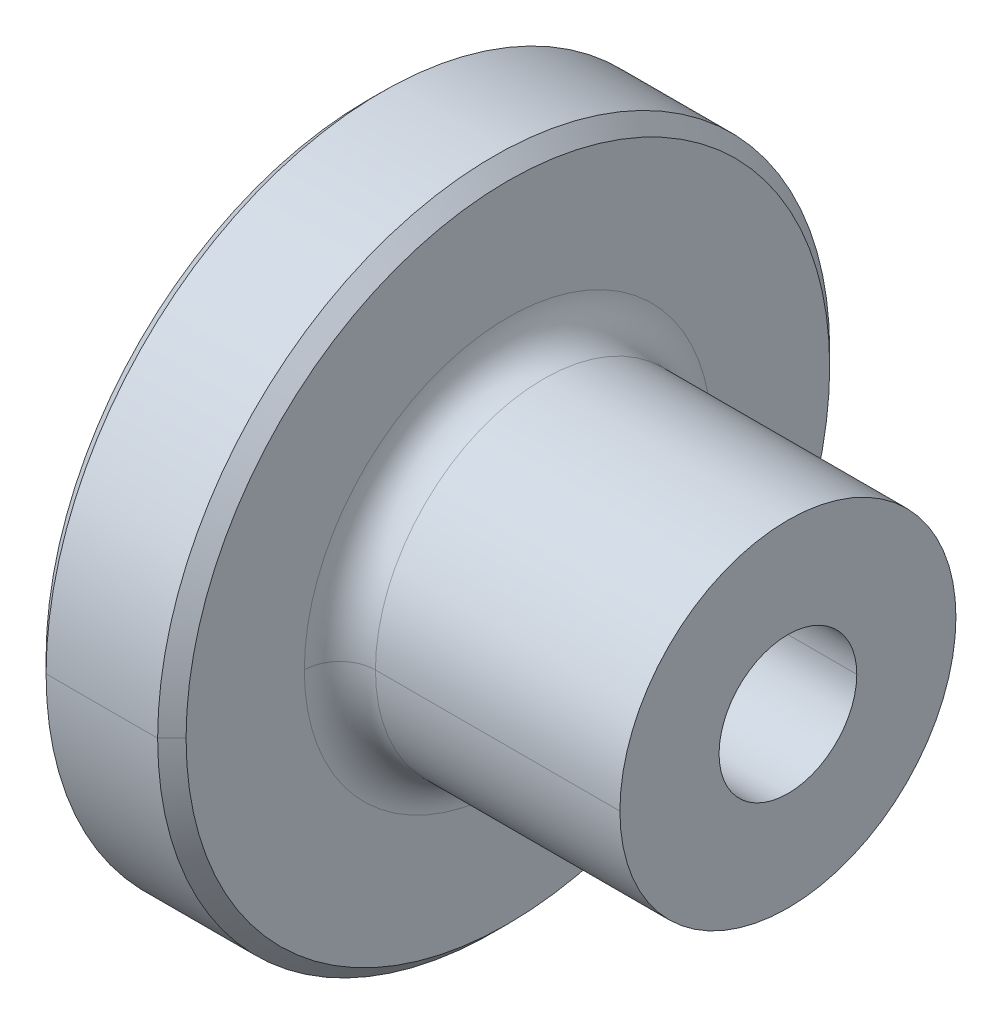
ISO-10303-21;
HEADER;
FILE_DESCRIPTION(('STEP AP214'),'2;1');
FILE_NAME('part.step','',(''),(''),'','','');
FILE_SCHEMA(('AUTOMOTIVE_DESIGN { 1 0 10303 214 1 1 1 1 }'));
ENDSEC;
DATA;
#1=APPLICATION_CONTEXT('core data for automotive mechanical design processes');
#2=APPLICATION_PROTOCOL_DEFINITION('international standard','automotive_design',2000,#1);
#3=PRODUCT_CONTEXT('',#1,'mechanical');
#4=PRODUCT('Part','Part','',(#3));
#5=PRODUCT_RELATED_PRODUCT_CATEGORY('part','',(#4));
#6=PRODUCT_DEFINITION_FORMATION('','',#4);
#7=PRODUCT_DEFINITION_CONTEXT('part definition',#1,'design');
#8=PRODUCT_DEFINITION('design','',#6,#7);
#9=PRODUCT_DEFINITION_SHAPE('','',#8);
#10=(LENGTH_UNIT() NAMED_UNIT(*) SI_UNIT(.MILLI.,.METRE.));
#11=(NAMED_UNIT(*) PLANE_ANGLE_UNIT() SI_UNIT($,.RADIAN.));
#12=(NAMED_UNIT(*) SI_UNIT($,.STERADIAN.) SOLID_ANGLE_UNIT());
#13=UNCERTAINTY_MEASURE_WITH_UNIT(LENGTH_MEASURE(1.E-05),#10,'distance_accuracy_value','');
#14=(GEOMETRIC_REPRESENTATION_CONTEXT(3) GLOBAL_UNCERTAINTY_ASSIGNED_CONTEXT((#13)) GLOBAL_UNIT_ASSIGNED_CONTEXT((#10,
#11,#12)) REPRESENTATION_CONTEXT('',''));
#15=CARTESIAN_POINT('',(0.,0.,0.));
#16=DIRECTION('',(0.,0.,1.));
#17=DIRECTION('',(1.,0.,0.));
#18=AXIS2_PLACEMENT_3D('',#15,#16,#17);
#19=CARTESIAN_POINT('',(2.51574357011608,0.,0.));
#20=DIRECTION('',(-1.,0.,0.));
#21=DIRECTION('',(0.,0.,1.));
#22=AXIS2_PLACEMENT_3D('',#19,#20,#21);
#23=CONICAL_SURFACE('',#22,5.73025642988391,0.785398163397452);
#24=CARTESIAN_POINT('',(2.49999999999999,0.,0.));
#25=DIRECTION('',(-1.,0.,0.));
#26=DIRECTION('',(0.,0.,1.));
#27=AXIS2_PLACEMENT_3D('',#24,#25,#26);
#28=CIRCLE('',#27,5.746);
#29=CARTESIAN_POINT('',(2.49999999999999,0.,-5.746));
#30=VERTEX_POINT('',#29);
#31=CARTESIAN_POINT('',(2.49999999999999,0.,5.746));
#32=VERTEX_POINT('',#31);
#33=EDGE_CURVE('E21',#30,#32,#28,.T.);
#34=ORIENTED_EDGE('',*,*,#33,.T.);
#35=DIRECTION('',(0.707106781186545,0.,-0.70710678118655));
#36=VECTOR('',#35,1.);
#37=CARTESIAN_POINT('',(2.246,0.,6.));
#38=LINE('',#37,#36);
#39=CARTESIAN_POINT('',(2.24599999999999,0.,6.));
#40=VERTEX_POINT('',#39);
#41=EDGE_CURVE('E95',#40,#32,#38,.T.);
#42=ORIENTED_EDGE('',*,*,#41,.F.);
#43=CARTESIAN_POINT('',(2.246,0.,0.));
#44=DIRECTION('',(1.,0.,0.));
#45=DIRECTION('',(0.,0.,1.));
#46=AXIS2_PLACEMENT_3D('',#43,#44,#45);
#47=CIRCLE('',#46,6.);
#48=CARTESIAN_POINT('',(2.24599999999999,0.,-6.));
#49=VERTEX_POINT('',#48);
#50=EDGE_CURVE('E97',#40,#49,#47,.T.);
#51=ORIENTED_EDGE('',*,*,#50,.T.);
#52=DIRECTION('',(0.707106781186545,0.,0.70710678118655));
#53=VECTOR('',#52,1.);
#54=CARTESIAN_POINT('',(2.246,0.,-6.));
#55=LINE('',#54,#53);
#56=EDGE_CURVE('E113',#49,#30,#55,.T.);
#57=ORIENTED_EDGE('',*,*,#56,.T.);
#58=EDGE_LOOP('',(#34,#42,#51,#57));
#59=FACE_BOUND('',#58,.T.);
#60=ADVANCED_FACE('F17',(#59),#23,.T.);
#61=CARTESIAN_POINT('',(2.51574357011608,0.,0.));
#62=DIRECTION('',(-1.,0.,0.));
#63=DIRECTION('',(0.,0.,1.));
#64=AXIS2_PLACEMENT_3D('',#61,#62,#63);
#65=CONICAL_SURFACE('',#64,5.73025642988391,0.785398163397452);
#66=ORIENTED_EDGE('',*,*,#56,.F.);
#67=CARTESIAN_POINT('',(2.246,0.,0.));
#68=DIRECTION('',(1.,0.,0.));
#69=DIRECTION('',(0.,0.,-1.));
#70=AXIS2_PLACEMENT_3D('',#67,#68,#69);
#71=CIRCLE('',#70,6.);
#72=EDGE_CURVE('E116',#49,#40,#71,.T.);
#73=ORIENTED_EDGE('',*,*,#72,.T.);
#74=ORIENTED_EDGE('',*,*,#41,.T.);
#75=CARTESIAN_POINT('',(2.49999999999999,0.,0.));
#76=DIRECTION('',(-1.,0.,0.));
#77=DIRECTION('',(0.,0.,1.));
#78=AXIS2_PLACEMENT_3D('',#75,#76,#77);
#79=CIRCLE('',#78,5.746);
#80=EDGE_CURVE('E52',#32,#30,#79,.T.);
#81=ORIENTED_EDGE('',*,*,#80,.T.);
#82=EDGE_LOOP('',(#66,#73,#74,#81));
#83=FACE_BOUND('',#82,.T.);
#84=ADVANCED_FACE('F117',(#83),#65,.T.);
#85=CARTESIAN_POINT('',(0.,0.,0.));
#86=DIRECTION('',(-1.,0.,0.));
#87=DIRECTION('',(0.,0.,1.));
#88=AXIS2_PLACEMENT_3D('',#85,#86,#87);
#89=CYLINDRICAL_SURFACE('',#88,6.);
#90=DIRECTION('',(1.,0.,0.));
#91=VECTOR('',#90,1.);
#92=CARTESIAN_POINT('',(0.254000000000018,0.,-6.));
#93=LINE('',#92,#91);
#94=CARTESIAN_POINT('',(0.254000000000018,0.,-6.));
#95=VERTEX_POINT('',#94);
#96=EDGE_CURVE('E111',#95,#49,#93,.T.);
#97=ORIENTED_EDGE('',*,*,#96,.F.);
#98=CARTESIAN_POINT('',(0.254000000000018,0.,0.));
#99=DIRECTION('',(-1.,0.,0.));
#100=DIRECTION('',(0.,0.,1.));
#101=AXIS2_PLACEMENT_3D('',#98,#99,#100);
#102=CIRCLE('',#101,6.);
#103=CARTESIAN_POINT('',(0.254000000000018,0.,6.));
#104=VERTEX_POINT('',#103);
#105=EDGE_CURVE('E123',#104,#95,#102,.T.);
#106=ORIENTED_EDGE('',*,*,#105,.F.);
#107=DIRECTION('',(1.,0.,0.));
#108=VECTOR('',#107,1.);
#109=CARTESIAN_POINT('',(0.254000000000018,0.,6.));
#110=LINE('',#109,#108);
#111=EDGE_CURVE('E109',#104,#40,#110,.T.);
#112=ORIENTED_EDGE('',*,*,#111,.T.);
#113=ORIENTED_EDGE('',*,*,#72,.F.);
#114=EDGE_LOOP('',(#97,#106,#112,#113));
#115=FACE_BOUND('',#114,.T.);
#116=ADVANCED_FACE('F121',(#115),#89,.T.);
#117=CARTESIAN_POINT('',(0.,0.,0.));
#118=DIRECTION('',(-1.,0.,0.));
#119=DIRECTION('',(0.,0.,1.));
#120=AXIS2_PLACEMENT_3D('',#117,#118,#119);
#121=CYLINDRICAL_SURFACE('',#120,6.);
#122=ORIENTED_EDGE('',*,*,#50,.F.);
#123=ORIENTED_EDGE('',*,*,#111,.F.);
#124=CARTESIAN_POINT('',(0.254000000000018,0.,0.));
#125=DIRECTION('',(-1.,0.,0.));
#126=DIRECTION('',(0.,0.,-1.));
#127=AXIS2_PLACEMENT_3D('',#124,#125,#126);
#128=CIRCLE('',#127,6.);
#129=EDGE_CURVE('E125',#95,#104,#128,.T.);
#130=ORIENTED_EDGE('',*,*,#129,.F.);
#131=ORIENTED_EDGE('',*,*,#96,.T.);
#132=EDGE_LOOP('',(#122,#123,#130,#131));
#133=FACE_BOUND('',#132,.T.);
#134=ADVANCED_FACE('F106',(#133),#121,.T.);
#135=CARTESIAN_POINT('',(-0.0157435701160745,0.,0.));
#136=DIRECTION('',(1.,0.,0.));
#137=DIRECTION('',(0.,0.,-1.));
#138=AXIS2_PLACEMENT_3D('',#135,#136,#137);
#139=CONICAL_SURFACE('',#138,5.73025642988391,0.785398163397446);
#140=DIRECTION('',(-0.707106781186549,0.,-0.707106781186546));
#141=VECTOR('',#140,1.);
#142=CARTESIAN_POINT('',(0.254000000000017,0.,6.));
#143=LINE('',#142,#141);
#144=CARTESIAN_POINT('',(0.,0.,5.74599999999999));
#145=VERTEX_POINT('',#144);
#146=EDGE_CURVE('E130',#104,#145,#143,.T.);
#147=ORIENTED_EDGE('',*,*,#146,.F.);
#148=ORIENTED_EDGE('',*,*,#105,.T.);
#149=DIRECTION('',(-0.707106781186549,0.,0.707106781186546));
#150=VECTOR('',#149,1.);
#151=CARTESIAN_POINT('',(0.254000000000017,0.,-6.));
#152=LINE('',#151,#150);
#153=CARTESIAN_POINT('',(0.,0.,-5.74599999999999));
#154=VERTEX_POINT('',#153);
#155=EDGE_CURVE('E137',#95,#154,#152,.T.);
#156=ORIENTED_EDGE('',*,*,#155,.T.);
#157=CARTESIAN_POINT('',(0.,0.,0.));
#158=DIRECTION('',(1.,0.,0.));
#159=DIRECTION('',(0.,0.,-1.));
#160=AXIS2_PLACEMENT_3D('',#157,#158,#159);
#161=CIRCLE('',#160,5.746);
#162=EDGE_CURVE('E140',#154,#145,#161,.T.);
#163=ORIENTED_EDGE('',*,*,#162,.T.);
#164=EDGE_LOOP('',(#147,#148,#156,#163));
#165=FACE_BOUND('',#164,.T.);
#166=ADVANCED_FACE('F305',(#165),#139,.T.);
#167=CARTESIAN_POINT('',(-0.0157435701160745,0.,0.));
#168=DIRECTION('',(1.,0.,0.));
#169=DIRECTION('',(0.,0.,-1.));
#170=AXIS2_PLACEMENT_3D('',#167,#168,#169);
#171=CONICAL_SURFACE('',#170,5.73025642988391,0.785398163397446);
#172=CARTESIAN_POINT('',(0.,0.,0.));
#173=DIRECTION('',(1.,0.,0.));
#174=DIRECTION('',(0.,0.,1.));
#175=AXIS2_PLACEMENT_3D('',#172,#173,#174);
#176=CIRCLE('',#175,5.746);
#177=EDGE_CURVE('E144',#145,#154,#176,.T.);
#178=ORIENTED_EDGE('',*,*,#177,.T.);
#179=ORIENTED_EDGE('',*,*,#155,.F.);
#180=ORIENTED_EDGE('',*,*,#129,.T.);
#181=ORIENTED_EDGE('',*,*,#146,.T.);
#182=EDGE_LOOP('',(#178,#179,#180,#181));
#183=FACE_BOUND('',#182,.T.);
#184=ADVANCED_FACE('F295',(#183),#171,.T.);
#185=CARTESIAN_POINT('',(0.,6.00000000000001,0.));
#186=DIRECTION('',(1.,0.,0.));
#187=DIRECTION('',(0.,0.,-1.));
#188=AXIS2_PLACEMENT_3D('',#185,#186,#187);
#189=PLANE('',#188);
#190=CARTESIAN_POINT('',(0.,0.,0.));
#191=DIRECTION('',(1.,0.,0.));
#192=DIRECTION('',(0.,0.,1.));
#193=AXIS2_PLACEMENT_3D('',#190,#191,#192);
#194=CIRCLE('',#193,1.2295);
#195=CARTESIAN_POINT('',(0.,0.,1.2295));
#196=VERTEX_POINT('',#195);
#197=CARTESIAN_POINT('',(0.,0.,-1.2295));
#198=VERTEX_POINT('',#197);
#199=EDGE_CURVE('E148',#196,#198,#194,.T.);
#200=ORIENTED_EDGE('',*,*,#199,.T.);
#201=CARTESIAN_POINT('',(0.,0.,0.));
#202=DIRECTION('',(1.,0.,0.));
#203=DIRECTION('',(0.,0.,-1.));
#204=AXIS2_PLACEMENT_3D('',#201,#202,#203);
#205=CIRCLE('',#204,1.2295);
#206=EDGE_CURVE('E151',#198,#196,#205,.T.);
#207=ORIENTED_EDGE('',*,*,#206,.T.);
#208=EDGE_LOOP('',(#200,#207));
#209=FACE_BOUND('',#208,.T.);
#210=ORIENTED_EDGE('',*,*,#162,.F.);
#211=ORIENTED_EDGE('',*,*,#177,.F.);
#212=EDGE_LOOP('',(#210,#211));
#213=FACE_BOUND('',#212,.T.);
#214=ADVANCED_FACE('F286',(#209,#213),#189,.F.);
#215=CARTESIAN_POINT('',(0.,0.,0.));
#216=DIRECTION('',(-1.,0.,0.));
#217=DIRECTION('',(0.,0.,1.));
#218=AXIS2_PLACEMENT_3D('',#215,#216,#217);
#219=CYLINDRICAL_SURFACE('',#218,3.);
#220=DIRECTION('',(1.,0.,0.));
#221=VECTOR('',#220,1.);
#222=CARTESIAN_POINT('',(3.135,0.,-3.));
#223=LINE('',#222,#221);
#224=CARTESIAN_POINT('',(3.135,0.,-3.));
#225=VERTEX_POINT('',#224);
#226=CARTESIAN_POINT('',(7.5,0.,-3.));
#227=VERTEX_POINT('',#226);
#228=EDGE_CURVE('E155',#225,#227,#223,.T.);
#229=ORIENTED_EDGE('',*,*,#228,.F.);
#230=CARTESIAN_POINT('',(3.135,0.,0.));
#231=DIRECTION('',(-1.,0.,0.));
#232=DIRECTION('',(0.,0.,1.));
#233=AXIS2_PLACEMENT_3D('',#230,#231,#232);
#234=CIRCLE('',#233,3.);
#235=CARTESIAN_POINT('',(3.135,0.,3.));
#236=VERTEX_POINT('',#235);
#237=EDGE_CURVE('E189',#225,#236,#234,.F.);
#238=ORIENTED_EDGE('',*,*,#237,.T.);
#239=DIRECTION('',(1.,0.,0.));
#240=VECTOR('',#239,1.);
#241=CARTESIAN_POINT('',(3.135,0.,3.));
#242=LINE('',#241,#240);
#243=CARTESIAN_POINT('',(7.5,0.,3.));
#244=VERTEX_POINT('',#243);
#245=EDGE_CURVE('E161',#236,#244,#242,.T.);
#246=ORIENTED_EDGE('',*,*,#245,.T.);
#247=CARTESIAN_POINT('',(7.5,0.,0.));
#248=DIRECTION('',(1.,0.,0.));
#249=DIRECTION('',(0.,0.,-1.));
#250=AXIS2_PLACEMENT_3D('',#247,#248,#249);
#251=CIRCLE('',#250,3.);
#252=EDGE_CURVE('E156',#227,#244,#251,.T.);
#253=ORIENTED_EDGE('',*,*,#252,.F.);
#254=EDGE_LOOP('',(#229,#238,#246,#253));
#255=FACE_BOUND('',#254,.T.);
#256=ADVANCED_FACE('F277',(#255),#219,.T.);
#257=CARTESIAN_POINT('',(0.,0.,0.));
#258=DIRECTION('',(-1.,0.,0.));
#259=DIRECTION('',(0.,0.,1.));
#260=AXIS2_PLACEMENT_3D('',#257,#258,#259);
#261=CYLINDRICAL_SURFACE('',#260,3.);
#262=CARTESIAN_POINT('',(7.5,0.,0.));
#263=DIRECTION('',(1.,0.,0.));
#264=DIRECTION('',(0.,0.,1.));
#265=AXIS2_PLACEMENT_3D('',#262,#263,#264);
#266=CIRCLE('',#265,3.);
#267=EDGE_CURVE('E160',#244,#227,#266,.T.);
#268=ORIENTED_EDGE('',*,*,#267,.F.);
#269=ORIENTED_EDGE('',*,*,#245,.F.);
#270=CARTESIAN_POINT('',(3.135,0.,0.));
#271=DIRECTION('',(-1.,0.,0.));
#272=DIRECTION('',(0.,0.,1.));
#273=AXIS2_PLACEMENT_3D('',#270,#271,#272);
#274=CIRCLE('',#273,3.);
#275=EDGE_CURVE('E190',#236,#225,#274,.F.);
#276=ORIENTED_EDGE('',*,*,#275,.T.);
#277=ORIENTED_EDGE('',*,*,#228,.T.);
#278=EDGE_LOOP('',(#268,#269,#276,#277));
#279=FACE_BOUND('',#278,.T.);
#280=ADVANCED_FACE('F267',(#279),#261,.T.);
#281=CARTESIAN_POINT('',(7.5,0.,0.));
#282=DIRECTION('',(-1.,0.,0.));
#283=DIRECTION('',(0.,0.,1.));
#284=AXIS2_PLACEMENT_3D('',#281,#282,#283);
#285=PLANE('',#284);
#286=CARTESIAN_POINT('',(7.5,0.,0.));
#287=DIRECTION('',(1.,0.,0.));
#288=DIRECTION('',(0.,0.,1.));
#289=AXIS2_PLACEMENT_3D('',#286,#287,#288);
#290=CIRCLE('',#289,1.2295);
#291=CARTESIAN_POINT('',(7.5,0.,1.2295));
#292=VERTEX_POINT('',#291);
#293=CARTESIAN_POINT('',(7.5,0.,-1.2295));
#294=VERTEX_POINT('',#293);
#295=EDGE_CURVE('E61',#292,#294,#290,.T.);
#296=ORIENTED_EDGE('',*,*,#295,.F.);
#297=CARTESIAN_POINT('',(7.5,0.,0.));
#298=DIRECTION('',(1.,0.,0.));
#299=DIRECTION('',(0.,0.,-1.));
#300=AXIS2_PLACEMENT_3D('',#297,#298,#299);
#301=CIRCLE('',#300,1.2295);
#302=EDGE_CURVE('E167',#294,#292,#301,.T.);
#303=ORIENTED_EDGE('',*,*,#302,.F.);
#304=EDGE_LOOP('',(#296,#303));
#305=FACE_BOUND('',#304,.T.);
#306=ORIENTED_EDGE('',*,*,#267,.T.);
#307=ORIENTED_EDGE('',*,*,#252,.T.);
#308=EDGE_LOOP('',(#306,#307));
#309=FACE_BOUND('',#308,.T.);
#310=ADVANCED_FACE('F259',(#305,#309),#285,.F.);
#311=CARTESIAN_POINT('',(7.5,0.,0.));
#312=DIRECTION('',(-1.,0.,0.));
#313=DIRECTION('',(0.,0.,1.));
#314=AXIS2_PLACEMENT_3D('',#311,#312,#313);
#315=CYLINDRICAL_SURFACE('',#314,1.2295);
#316=DIRECTION('',(1.,0.,0.));
#317=VECTOR('',#316,1.);
#318=CARTESIAN_POINT('',(0.,0.,-1.2295));
#319=LINE('',#318,#317);
#320=EDGE_CURVE('E171',#198,#294,#319,.T.);
#321=ORIENTED_EDGE('',*,*,#320,.F.);
#322=ORIENTED_EDGE('',*,*,#199,.F.);
#323=DIRECTION('',(1.,0.,0.));
#324=VECTOR('',#323,1.);
#325=CARTESIAN_POINT('',(0.,0.,1.2295));
#326=LINE('',#325,#324);
#327=EDGE_CURVE('E175',#196,#292,#326,.T.);
#328=ORIENTED_EDGE('',*,*,#327,.T.);
#329=ORIENTED_EDGE('',*,*,#295,.T.);
#330=EDGE_LOOP('',(#321,#322,#328,#329));
#331=FACE_BOUND('',#330,.T.);
#332=ADVANCED_FACE('F224',(#331),#315,.F.);
#333=CARTESIAN_POINT('',(7.5,0.,0.));
#334=DIRECTION('',(-1.,0.,0.));
#335=DIRECTION('',(0.,0.,1.));
#336=AXIS2_PLACEMENT_3D('',#333,#334,#335);
#337=CYLINDRICAL_SURFACE('',#336,1.2295);
#338=ORIENTED_EDGE('',*,*,#302,.T.);
#339=ORIENTED_EDGE('',*,*,#327,.F.);
#340=ORIENTED_EDGE('',*,*,#206,.F.);
#341=ORIENTED_EDGE('',*,*,#320,.T.);
#342=EDGE_LOOP('',(#338,#339,#340,#341));
#343=FACE_BOUND('',#342,.T.);
#344=ADVANCED_FACE('F19',(#343),#337,.F.);
#345=CARTESIAN_POINT('',(2.5,3.,0.));
#346=DIRECTION('',(-1.,0.,0.));
#347=DIRECTION('',(0.,0.,1.));
#348=AXIS2_PLACEMENT_3D('',#345,#346,#347);
#349=PLANE('',#348);
#350=CARTESIAN_POINT('',(2.5,0.,0.));
#351=DIRECTION('',(-1.,0.,0.));
#352=DIRECTION('',(0.,0.,1.));
#353=AXIS2_PLACEMENT_3D('',#350,#351,#352);
#354=CIRCLE('',#353,3.635);
#355=CARTESIAN_POINT('',(2.5,0.,-3.635));
#356=VERTEX_POINT('',#355);
#357=CARTESIAN_POINT('',(2.5,0.,3.635));
#358=VERTEX_POINT('',#357);
#359=EDGE_CURVE('E36',#356,#358,#354,.T.);
#360=ORIENTED_EDGE('',*,*,#359,.T.);
#361=CARTESIAN_POINT('',(2.5,0.,0.));
#362=DIRECTION('',(-1.,0.,0.));
#363=DIRECTION('',(0.,0.,1.));
#364=AXIS2_PLACEMENT_3D('',#361,#362,#363);
#365=CIRCLE('',#364,3.635);
#366=EDGE_CURVE('E28',#358,#356,#365,.T.);
#367=ORIENTED_EDGE('',*,*,#366,.T.);
#368=EDGE_LOOP('',(#360,#367));
#369=FACE_BOUND('',#368,.T.);
#370=ORIENTED_EDGE('',*,*,#33,.F.);
#371=ORIENTED_EDGE('',*,*,#80,.F.);
#372=EDGE_LOOP('',(#370,#371));
#373=FACE_BOUND('',#372,.T.);
#374=ADVANCED_FACE('F215',(#369,#373),#349,.F.);
#375=CARTESIAN_POINT('',(3.135,0.,0.));
#376=DIRECTION('',(-1.,0.,0.));
#377=DIRECTION('',(0.,0.,1.));
#378=AXIS2_PLACEMENT_3D('',#375,#376,#377);
#379=TOROIDAL_SURFACE('',#378,3.635,0.635);
#380=ORIENTED_EDGE('',*,*,#359,.F.);
#381=CARTESIAN_POINT('',(3.135,0.,-3.635));
#382=DIRECTION('',(0.,1.,0.));
#383=DIRECTION('',(0.,0.,1.));
#384=AXIS2_PLACEMENT_3D('',#381,#382,#383);
#385=CIRCLE('',#384,0.635);
#386=EDGE_CURVE('E11',#356,#225,#385,.T.);
#387=ORIENTED_EDGE('',*,*,#386,.T.);
#388=ORIENTED_EDGE('',*,*,#275,.F.);
#389=CARTESIAN_POINT('',(3.135,0.,3.635));
#390=DIRECTION('',(0.,-1.,0.));
#391=DIRECTION('',(0.,0.,-1.));
#392=AXIS2_PLACEMENT_3D('',#389,#390,#391);
#393=CIRCLE('',#392,0.635);
#394=EDGE_CURVE('E187',#236,#358,#393,.F.);
#395=ORIENTED_EDGE('',*,*,#394,.T.);
#396=EDGE_LOOP('',(#380,#387,#388,#395));
#397=FACE_BOUND('',#396,.T.);
#398=ADVANCED_FACE('F210',(#397),#379,.F.);
#399=CARTESIAN_POINT('',(3.135,0.,0.));
#400=DIRECTION('',(-1.,0.,0.));
#401=DIRECTION('',(0.,0.,1.));
#402=AXIS2_PLACEMENT_3D('',#399,#400,#401);
#403=TOROIDAL_SURFACE('',#402,3.635,0.635);
#404=ORIENTED_EDGE('',*,*,#366,.F.);
#405=ORIENTED_EDGE('',*,*,#394,.F.);
#406=ORIENTED_EDGE('',*,*,#237,.F.);
#407=ORIENTED_EDGE('',*,*,#386,.F.);
#408=EDGE_LOOP('',(#404,#405,#406,#407));
#409=FACE_BOUND('',#408,.T.);
#410=ADVANCED_FACE('F213',(#409),#403,.F.);
#411=CLOSED_SHELL('',(#60,#84,#116,#134,#166,#184,#214,#256,#280,#310,#332,#344,#374,#398,#410));
#412=MANIFOLD_SOLID_BREP('B1',#411);
#413=ADVANCED_BREP_SHAPE_REPRESENTATION('',(#18,#412),#14);
#414=SHAPE_DEFINITION_REPRESENTATION(#9,#413);
ENDSEC;
END-ISO-10303-21;
